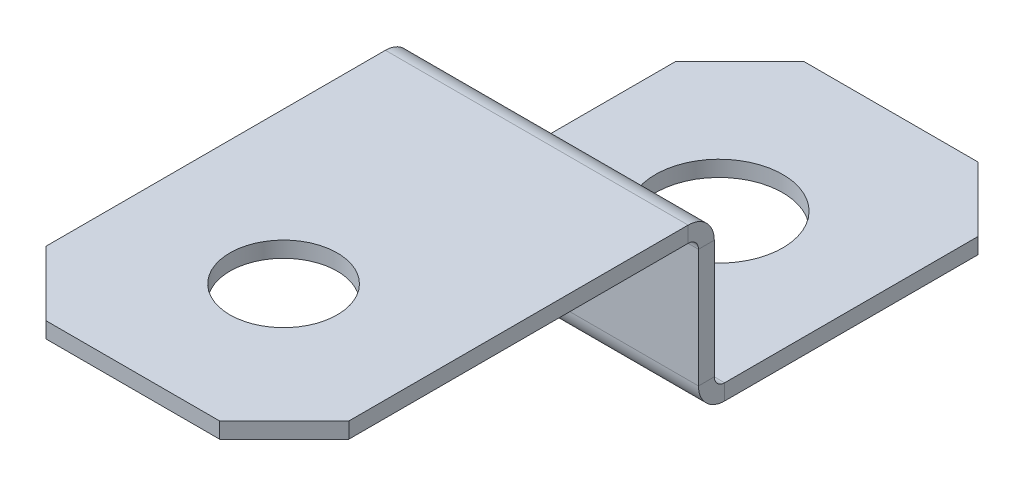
ISO-10303-21;
HEADER;
FILE_DESCRIPTION(('STEP AP214'),'2;1');
FILE_NAME('part.step','',(''),(''),'','','');
FILE_SCHEMA(('AUTOMOTIVE_DESIGN { 1 0 10303 214 1 1 1 1 }'));
ENDSEC;
DATA;
#1=APPLICATION_CONTEXT('core data for automotive mechanical design processes');
#2=APPLICATION_PROTOCOL_DEFINITION('international standard','automotive_design',2000,#1);
#3=PRODUCT_CONTEXT('',#1,'mechanical');
#4=PRODUCT('Part','Part','',(#3));
#5=PRODUCT_RELATED_PRODUCT_CATEGORY('part','',(#4));
#6=PRODUCT_DEFINITION_FORMATION('','',#4);
#7=PRODUCT_DEFINITION_CONTEXT('part definition',#1,'design');
#8=PRODUCT_DEFINITION('design','',#6,#7);
#9=PRODUCT_DEFINITION_SHAPE('','',#8);
#10=(LENGTH_UNIT() NAMED_UNIT(*) SI_UNIT(.MILLI.,.METRE.));
#11=(NAMED_UNIT(*) PLANE_ANGLE_UNIT() SI_UNIT($,.RADIAN.));
#12=(NAMED_UNIT(*) SI_UNIT($,.STERADIAN.) SOLID_ANGLE_UNIT());
#13=UNCERTAINTY_MEASURE_WITH_UNIT(LENGTH_MEASURE(1.E-05),#10,'distance_accuracy_value','');
#14=(GEOMETRIC_REPRESENTATION_CONTEXT(3) GLOBAL_UNCERTAINTY_ASSIGNED_CONTEXT((#13)) GLOBAL_UNIT_ASSIGNED_CONTEXT((#10,
#11,#12)) REPRESENTATION_CONTEXT('',''));
#15=CARTESIAN_POINT('',(0.,0.,0.));
#16=DIRECTION('',(0.,0.,1.));
#17=DIRECTION('',(1.,0.,0.));
#18=AXIS2_PLACEMENT_3D('',#15,#16,#17);
#19=CARTESIAN_POINT('',(5.588,-0.9652,-10.3124));
#20=DIRECTION('',(1.,0.,0.));
#21=DIRECTION('',(0.,0.,-1.));
#22=AXIS2_PLACEMENT_3D('',#19,#20,#21);
#23=PLANE('',#22);
#24=DIRECTION('',(0.,0.,1.));
#25=VECTOR('',#24,1.);
#26=CARTESIAN_POINT('',(5.588,-0.9652,-10.3124));
#27=LINE('',#26,#25);
#28=CARTESIAN_POINT('',(5.588,-0.9652,-10.3124));
#29=VERTEX_POINT('',#28);
#30=CARTESIAN_POINT('',(5.588,-0.9652,-9.7282));
#31=VERTEX_POINT('',#30);
#32=EDGE_CURVE('E272',#29,#31,#27,.T.);
#33=ORIENTED_EDGE('',*,*,#32,.F.);
#34=CARTESIAN_POINT('',(5.588,-0.9652,-9.3472));
#35=DIRECTION('',(1.,0.,0.));
#36=DIRECTION('',(0.,0.,-1.));
#37=AXIS2_PLACEMENT_3D('',#34,#35,#36);
#38=CIRCLE('',#37,0.9652);
#39=CARTESIAN_POINT('',(5.588,0.,-9.3472));
#40=VERTEX_POINT('',#39);
#41=EDGE_CURVE('E189',#40,#29,#38,.F.);
#42=ORIENTED_EDGE('',*,*,#41,.F.);
#43=DIRECTION('',(0.,1.,0.));
#44=VECTOR('',#43,1.);
#45=CARTESIAN_POINT('',(5.588,-0.5842,-9.3472));
#46=LINE('',#45,#44);
#47=CARTESIAN_POINT('',(5.588,-0.5842,-9.3472));
#48=VERTEX_POINT('',#47);
#49=EDGE_CURVE('E269',#48,#40,#46,.T.);
#50=ORIENTED_EDGE('',*,*,#49,.F.);
#51=CARTESIAN_POINT('',(5.588,-0.9652,-9.3472));
#52=DIRECTION('',(1.,0.,0.));
#53=DIRECTION('',(0.,0.,-1.));
#54=AXIS2_PLACEMENT_3D('',#51,#52,#53);
#55=CIRCLE('',#54,0.381);
#56=EDGE_CURVE('E199',#48,#31,#55,.F.);
#57=ORIENTED_EDGE('',*,*,#56,.T.);
#58=EDGE_LOOP('',(#33,#42,#50,#57));
#59=FACE_BOUND('',#58,.T.);
#60=ADVANCED_FACE('F39',(#59),#23,.T.);
#61=CARTESIAN_POINT('',(5.588,-0.5842,-9.3472));
#62=DIRECTION('',(1.,0.,0.));
#63=DIRECTION('',(0.,0.,-1.));
#64=AXIS2_PLACEMENT_3D('',#61,#62,#63);
#65=PLANE('',#64);
#66=DIRECTION('',(0.,-1.,0.));
#67=VECTOR('',#66,1.);
#68=CARTESIAN_POINT('',(5.588,0.,-10.3124));
#69=LINE('',#68,#67);
#70=CARTESIAN_POINT('',(5.588,-5.334,-10.3124));
#71=VERTEX_POINT('',#70);
#72=EDGE_CURVE('E187',#29,#71,#69,.T.);
#73=ORIENTED_EDGE('',*,*,#72,.F.);
#74=ORIENTED_EDGE('',*,*,#32,.T.);
#75=DIRECTION('',(0.,-1.,0.));
#76=VECTOR('',#75,1.);
#77=CARTESIAN_POINT('',(5.588,0.,-9.7282));
#78=LINE('',#77,#76);
#79=CARTESIAN_POINT('',(5.588,-5.334,-9.7282));
#80=VERTEX_POINT('',#79);
#81=EDGE_CURVE('E202',#31,#80,#78,.T.);
#82=ORIENTED_EDGE('',*,*,#81,.T.);
#83=DIRECTION('',(0.,0.,-1.));
#84=VECTOR('',#83,1.);
#85=CARTESIAN_POINT('',(5.588,-5.334,-9.7282));
#86=LINE('',#85,#84);
#87=EDGE_CURVE('E164',#80,#71,#86,.T.);
#88=ORIENTED_EDGE('',*,*,#87,.T.);
#89=EDGE_LOOP('',(#73,#74,#82,#88));
#90=FACE_BOUND('',#89,.T.);
#91=ADVANCED_FACE('F349',(#90),#65,.T.);
#92=CARTESIAN_POINT('',(-5.588,0.,-9.3472));
#93=DIRECTION('',(-1.,0.,0.));
#94=DIRECTION('',(0.,0.,1.));
#95=AXIS2_PLACEMENT_3D('',#92,#93,#94);
#96=PLANE('',#95);
#97=DIRECTION('',(0.,-1.,0.));
#98=VECTOR('',#97,1.);
#99=CARTESIAN_POINT('',(-5.588,0.,-9.3472));
#100=LINE('',#99,#98);
#101=CARTESIAN_POINT('',(-5.588,0.,-9.3472));
#102=VERTEX_POINT('',#101);
#103=CARTESIAN_POINT('',(-5.588,-0.5842,-9.3472));
#104=VERTEX_POINT('',#103);
#105=EDGE_CURVE('E266',#102,#104,#100,.T.);
#106=ORIENTED_EDGE('',*,*,#105,.F.);
#107=CARTESIAN_POINT('',(-5.588,-0.9652,-9.3472));
#108=DIRECTION('',(1.,0.,0.));
#109=DIRECTION('',(0.,0.,-1.));
#110=AXIS2_PLACEMENT_3D('',#107,#108,#109);
#111=CIRCLE('',#110,0.9652);
#112=CARTESIAN_POINT('',(-5.588,-0.9652,-10.3124));
#113=VERTEX_POINT('',#112);
#114=EDGE_CURVE('E217',#102,#113,#111,.F.);
#115=ORIENTED_EDGE('',*,*,#114,.T.);
#116=DIRECTION('',(0.,0.,-1.));
#117=VECTOR('',#116,1.);
#118=CARTESIAN_POINT('',(-5.588,-0.9652,-9.7282));
#119=LINE('',#118,#117);
#120=CARTESIAN_POINT('',(-5.588,-0.9652,-9.7282));
#121=VERTEX_POINT('',#120);
#122=EDGE_CURVE('E163',#121,#113,#119,.T.);
#123=ORIENTED_EDGE('',*,*,#122,.F.);
#124=CARTESIAN_POINT('',(-5.588,-0.9652,-9.3472));
#125=DIRECTION('',(1.,0.,0.));
#126=DIRECTION('',(0.,0.,-1.));
#127=AXIS2_PLACEMENT_3D('',#124,#125,#126);
#128=CIRCLE('',#127,0.381);
#129=EDGE_CURVE('E224',#104,#121,#128,.F.);
#130=ORIENTED_EDGE('',*,*,#129,.F.);
#131=EDGE_LOOP('',(#106,#115,#123,#130));
#132=FACE_BOUND('',#131,.T.);
#133=ADVANCED_FACE('F355',(#132),#96,.T.);
#134=CARTESIAN_POINT('',(-5.588,-0.9652,-9.7282));
#135=DIRECTION('',(-1.,0.,0.));
#136=DIRECTION('',(0.,0.,1.));
#137=AXIS2_PLACEMENT_3D('',#134,#135,#136);
#138=PLANE('',#137);
#139=DIRECTION('',(0.,0.,-1.));
#140=VECTOR('',#139,1.);
#141=CARTESIAN_POINT('',(-5.588,-0.5842,5.5626));
#142=LINE('',#141,#140);
#143=CARTESIAN_POINT('',(-5.588,-0.5842,3.18135));
#144=VERTEX_POINT('',#143);
#145=EDGE_CURVE('E222',#144,#104,#142,.T.);
#146=ORIENTED_EDGE('',*,*,#145,.F.);
#147=DIRECTION('',(0.,1.,0.));
#148=VECTOR('',#147,1.);
#149=CARTESIAN_POINT('',(-5.588,-0.9652,3.18135));
#150=LINE('',#149,#148);
#151=CARTESIAN_POINT('',(-5.588,0.,3.18135));
#152=VERTEX_POINT('',#151);
#153=EDGE_CURVE('E274',#144,#152,#150,.T.);
#154=ORIENTED_EDGE('',*,*,#153,.T.);
#155=DIRECTION('',(0.,0.,-1.));
#156=VECTOR('',#155,1.);
#157=CARTESIAN_POINT('',(-5.588,0.,5.5626));
#158=LINE('',#157,#156);
#159=EDGE_CURVE('E220',#152,#102,#158,.T.);
#160=ORIENTED_EDGE('',*,*,#159,.T.);
#161=ORIENTED_EDGE('',*,*,#105,.T.);
#162=EDGE_LOOP('',(#146,#154,#160,#161));
#163=FACE_BOUND('',#162,.T.);
#164=ADVANCED_FACE('F453',(#163),#138,.T.);
#165=CARTESIAN_POINT('',(5.588,-5.715,-10.6934));
#166=DIRECTION('',(1.,0.,0.));
#167=DIRECTION('',(0.,0.,-1.));
#168=AXIS2_PLACEMENT_3D('',#165,#166,#167);
#169=PLANE('',#168);
#170=DIRECTION('',(0.,-1.,0.));
#171=VECTOR('',#170,1.);
#172=CARTESIAN_POINT('',(5.588,-5.715,-10.6934));
#173=LINE('',#172,#171);
#174=CARTESIAN_POINT('',(5.588,-5.715,-10.6934));
#175=VERTEX_POINT('',#174);
#176=CARTESIAN_POINT('',(5.588,-6.2992,-10.6934));
#177=VERTEX_POINT('',#176);
#178=EDGE_CURVE('E154',#175,#177,#173,.T.);
#179=ORIENTED_EDGE('',*,*,#178,.F.);
#180=CARTESIAN_POINT('',(5.588,-5.334,-10.6934));
#181=DIRECTION('',(-1.,0.,0.));
#182=DIRECTION('',(0.,0.,1.));
#183=AXIS2_PLACEMENT_3D('',#180,#181,#182);
#184=CIRCLE('',#183,0.381);
#185=EDGE_CURVE('E158',#71,#175,#184,.F.);
#186=ORIENTED_EDGE('',*,*,#185,.F.);
#187=ORIENTED_EDGE('',*,*,#87,.F.);
#188=CARTESIAN_POINT('',(5.588,-5.334,-10.6934));
#189=DIRECTION('',(1.,0.,0.));
#190=DIRECTION('',(0.,0.,-1.));
#191=AXIS2_PLACEMENT_3D('',#188,#189,#190);
#192=CIRCLE('',#191,0.9652);
#193=EDGE_CURVE('E161',#80,#177,#192,.T.);
#194=ORIENTED_EDGE('',*,*,#193,.T.);
#195=EDGE_LOOP('',(#179,#186,#187,#194));
#196=FACE_BOUND('',#195,.T.);
#197=ADVANCED_FACE('F156',(#196),#169,.T.);
#198=CARTESIAN_POINT('',(5.588,-5.334,-9.7282));
#199=DIRECTION('',(1.,0.,0.));
#200=DIRECTION('',(0.,0.,-1.));
#201=AXIS2_PLACEMENT_3D('',#198,#199,#200);
#202=PLANE('',#201);
#203=DIRECTION('',(0.,0.,-1.));
#204=VECTOR('',#203,1.);
#205=CARTESIAN_POINT('',(5.588,-6.2992,-10.3124));
#206=LINE('',#205,#204);
#207=CARTESIAN_POINT('',(5.588,-6.2992,-20.04695));
#208=VERTEX_POINT('',#207);
#209=EDGE_CURVE('E182',#177,#208,#206,.T.);
#210=ORIENTED_EDGE('',*,*,#209,.T.);
#211=DIRECTION('',(0.,1.,0.));
#212=VECTOR('',#211,1.);
#213=CARTESIAN_POINT('',(5.588,-5.334,-20.04695));
#214=LINE('',#213,#212);
#215=CARTESIAN_POINT('',(5.588,-5.715,-20.04695));
#216=VERTEX_POINT('',#215);
#217=EDGE_CURVE('E11',#208,#216,#214,.T.);
#218=ORIENTED_EDGE('',*,*,#217,.T.);
#219=DIRECTION('',(0.,0.,-1.));
#220=VECTOR('',#219,1.);
#221=CARTESIAN_POINT('',(5.588,-5.715,-10.3124));
#222=LINE('',#221,#220);
#223=EDGE_CURVE('E171',#175,#216,#222,.T.);
#224=ORIENTED_EDGE('',*,*,#223,.F.);
#225=ORIENTED_EDGE('',*,*,#178,.T.);
#226=EDGE_LOOP('',(#210,#218,#224,#225));
#227=FACE_BOUND('',#226,.T.);
#228=ADVANCED_FACE('F181',(#227),#202,.T.);
#229=CARTESIAN_POINT('',(-5.588,-5.334,-10.3124));
#230=DIRECTION('',(-1.,0.,0.));
#231=DIRECTION('',(0.,0.,1.));
#232=AXIS2_PLACEMENT_3D('',#229,#230,#231);
#233=PLANE('',#232);
#234=DIRECTION('',(0.,0.,1.));
#235=VECTOR('',#234,1.);
#236=CARTESIAN_POINT('',(-5.588,-5.334,-10.3124));
#237=LINE('',#236,#235);
#238=CARTESIAN_POINT('',(-5.588,-5.334,-10.3124));
#239=VERTEX_POINT('',#238);
#240=CARTESIAN_POINT('',(-5.588,-5.334,-9.7282));
#241=VERTEX_POINT('',#240);
#242=EDGE_CURVE('E262',#239,#241,#237,.T.);
#243=ORIENTED_EDGE('',*,*,#242,.F.);
#244=CARTESIAN_POINT('',(-5.588,-5.334,-10.6934));
#245=DIRECTION('',(-1.,0.,0.));
#246=DIRECTION('',(0.,0.,1.));
#247=AXIS2_PLACEMENT_3D('',#244,#245,#246);
#248=CIRCLE('',#247,0.381);
#249=CARTESIAN_POINT('',(-5.588,-5.715,-10.6934));
#250=VERTEX_POINT('',#249);
#251=EDGE_CURVE('E212',#239,#250,#248,.F.);
#252=ORIENTED_EDGE('',*,*,#251,.T.);
#253=DIRECTION('',(0.,1.,0.));
#254=VECTOR('',#253,1.);
#255=CARTESIAN_POINT('',(-5.588,-6.2992,-10.6934));
#256=LINE('',#255,#254);
#257=CARTESIAN_POINT('',(-5.588,-6.2992,-10.6934));
#258=VERTEX_POINT('',#257);
#259=EDGE_CURVE('E260',#258,#250,#256,.T.);
#260=ORIENTED_EDGE('',*,*,#259,.F.);
#261=CARTESIAN_POINT('',(-5.588,-5.334,-10.6934));
#262=DIRECTION('',(1.,0.,0.));
#263=DIRECTION('',(0.,0.,-1.));
#264=AXIS2_PLACEMENT_3D('',#261,#262,#263);
#265=CIRCLE('',#264,0.9652);
#266=EDGE_CURVE('E230',#241,#258,#265,.T.);
#267=ORIENTED_EDGE('',*,*,#266,.F.);
#268=EDGE_LOOP('',(#243,#252,#260,#267));
#269=FACE_BOUND('',#268,.T.);
#270=ADVANCED_FACE('F438',(#269),#233,.T.);
#271=CARTESIAN_POINT('',(-5.588,-6.2992,-10.6934));
#272=DIRECTION('',(-1.,0.,0.));
#273=DIRECTION('',(0.,0.,1.));
#274=AXIS2_PLACEMENT_3D('',#271,#272,#273);
#275=PLANE('',#274);
#276=DIRECTION('',(0.,-1.,0.));
#277=VECTOR('',#276,1.);
#278=CARTESIAN_POINT('',(-5.588,0.,-10.3124));
#279=LINE('',#278,#277);
#280=EDGE_CURVE('E214',#113,#239,#279,.T.);
#281=ORIENTED_EDGE('',*,*,#280,.T.);
#282=ORIENTED_EDGE('',*,*,#242,.T.);
#283=DIRECTION('',(0.,-1.,0.));
#284=VECTOR('',#283,1.);
#285=CARTESIAN_POINT('',(-5.588,0.,-9.7282));
#286=LINE('',#285,#284);
#287=EDGE_CURVE('E227',#121,#241,#286,.T.);
#288=ORIENTED_EDGE('',*,*,#287,.F.);
#289=ORIENTED_EDGE('',*,*,#122,.T.);
#290=EDGE_LOOP('',(#281,#282,#288,#289));
#291=FACE_BOUND('',#290,.T.);
#292=ADVANCED_FACE('F439',(#291),#275,.T.);
#293=CARTESIAN_POINT('',(5.588,-6.2992,-10.3124));
#294=DIRECTION('',(0.,1.,0.));
#295=DIRECTION('',(0.,0.,1.));
#296=AXIS2_PLACEMENT_3D('',#293,#294,#295);
#297=PLANE('',#296);
#298=CARTESIAN_POINT('',(0.,-6.2992,-16.0782));
#299=DIRECTION('',(0.,1.,0.));
#300=DIRECTION('',(0.,0.,1.));
#301=AXIS2_PLACEMENT_3D('',#298,#299,#300);
#302=CIRCLE('',#301,2.3495);
#303=CARTESIAN_POINT('',(0.,-6.2992,-13.7287));
#304=VERTEX_POINT('',#303);
#305=EDGE_CURVE('E322',#304,#304,#302,.T.);
#306=ORIENTED_EDGE('',*,*,#305,.T.);
#307=EDGE_LOOP('',(#306));
#308=FACE_BOUND('',#307,.T.);
#309=DIRECTION('',(0.,0.,-1.));
#310=VECTOR('',#309,1.);
#311=CARTESIAN_POINT('',(-5.588,-6.2992,-10.3124));
#312=LINE('',#311,#310);
#313=CARTESIAN_POINT('',(-5.588,-6.2992,-20.04695));
#314=VERTEX_POINT('',#313);
#315=EDGE_CURVE('E207',#258,#314,#312,.T.);
#316=ORIENTED_EDGE('',*,*,#315,.T.);
#317=DIRECTION('',(-0.707106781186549,0.,0.707106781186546));
#318=VECTOR('',#317,1.);
#319=CARTESIAN_POINT('',(-5.588,-6.2992,-20.04695));
#320=LINE('',#319,#318);
#321=CARTESIAN_POINT('',(-3.20675,-6.2992,-22.4282));
#322=VERTEX_POINT('',#321);
#323=EDGE_CURVE('E297',#314,#322,#320,.F.);
#324=ORIENTED_EDGE('',*,*,#323,.T.);
#325=DIRECTION('',(-1.,0.,0.));
#326=VECTOR('',#325,1.);
#327=CARTESIAN_POINT('',(5.588,-6.2992,-22.4282));
#328=LINE('',#327,#326);
#329=CARTESIAN_POINT('',(3.20675,-6.2992,-22.4282));
#330=VERTEX_POINT('',#329);
#331=EDGE_CURVE('E258',#330,#322,#328,.T.);
#332=ORIENTED_EDGE('',*,*,#331,.F.);
#333=DIRECTION('',(-0.707106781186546,0.,-0.707106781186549));
#334=VECTOR('',#333,1.);
#335=CARTESIAN_POINT('',(3.20675,-6.2992,-22.4282));
#336=LINE('',#335,#334);
#337=EDGE_CURVE('E295',#330,#208,#336,.F.);
#338=ORIENTED_EDGE('',*,*,#337,.T.);
#339=ORIENTED_EDGE('',*,*,#209,.F.);
#340=DIRECTION('',(-1.,0.,0.));
#341=VECTOR('',#340,1.);
#342=CARTESIAN_POINT('',(5.588,-6.2992,-10.6934));
#343=LINE('',#342,#341);
#344=EDGE_CURVE('E206',#177,#258,#343,.T.);
#345=ORIENTED_EDGE('',*,*,#344,.T.);
#346=EDGE_LOOP('',(#316,#324,#332,#338,#339,#345));
#347=FACE_BOUND('',#346,.T.);
#348=ADVANCED_FACE('F313',(#308,#347),#297,.F.);
#349=CARTESIAN_POINT('',(5.588,-5.715,-22.4282));
#350=DIRECTION('',(0.,0.,-1.));
#351=DIRECTION('',(-1.,0.,0.));
#352=AXIS2_PLACEMENT_3D('',#349,#350,#351);
#353=PLANE('',#352);
#354=ORIENTED_EDGE('',*,*,#331,.T.);
#355=DIRECTION('',(0.,1.,0.));
#356=VECTOR('',#355,1.);
#357=CARTESIAN_POINT('',(-3.20675,-5.715,-22.4282));
#358=LINE('',#357,#356);
#359=CARTESIAN_POINT('',(-3.20675,-5.715,-22.4282));
#360=VERTEX_POINT('',#359);
#361=EDGE_CURVE('E60',#322,#360,#358,.T.);
#362=ORIENTED_EDGE('',*,*,#361,.T.);
#363=DIRECTION('',(-1.,0.,0.));
#364=VECTOR('',#363,1.);
#365=CARTESIAN_POINT('',(5.588,-5.715,-22.4282));
#366=LINE('',#365,#364);
#367=CARTESIAN_POINT('',(3.20675,-5.715,-22.4282));
#368=VERTEX_POINT('',#367);
#369=EDGE_CURVE('E178',#368,#360,#366,.T.);
#370=ORIENTED_EDGE('',*,*,#369,.F.);
#371=DIRECTION('',(0.,-1.,0.));
#372=VECTOR('',#371,1.);
#373=CARTESIAN_POINT('',(3.20675,-5.715,-22.4282));
#374=LINE('',#373,#372);
#375=EDGE_CURVE('E299',#368,#330,#374,.T.);
#376=ORIENTED_EDGE('',*,*,#375,.T.);
#377=EDGE_LOOP('',(#354,#362,#370,#376));
#378=FACE_BOUND('',#377,.T.);
#379=ADVANCED_FACE('F314',(#378),#353,.T.);
#380=CARTESIAN_POINT('',(5.588,-5.715,-10.3124));
#381=DIRECTION('',(0.,1.,0.));
#382=DIRECTION('',(0.,0.,1.));
#383=AXIS2_PLACEMENT_3D('',#380,#381,#382);
#384=PLANE('',#383);
#385=CARTESIAN_POINT('',(0.,-5.715,-16.0782));
#386=DIRECTION('',(0.,1.,0.));
#387=DIRECTION('',(0.,0.,1.));
#388=AXIS2_PLACEMENT_3D('',#385,#386,#387);
#389=CIRCLE('',#388,2.3495);
#390=CARTESIAN_POINT('',(0.,-5.715,-13.7287));
#391=VERTEX_POINT('',#390);
#392=EDGE_CURVE('E325',#391,#391,#389,.T.);
#393=ORIENTED_EDGE('',*,*,#392,.F.);
#394=EDGE_LOOP('',(#393));
#395=FACE_BOUND('',#394,.T.);
#396=ORIENTED_EDGE('',*,*,#369,.T.);
#397=DIRECTION('',(0.707106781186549,0.,-0.707106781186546));
#398=VECTOR('',#397,1.);
#399=CARTESIAN_POINT('',(-4.86727499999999,-5.715,-20.767675));
#400=LINE('',#399,#398);
#401=CARTESIAN_POINT('',(-5.588,-5.715,-20.04695));
#402=VERTEX_POINT('',#401);
#403=EDGE_CURVE('E47',#360,#402,#400,.F.);
#404=ORIENTED_EDGE('',*,*,#403,.T.);
#405=DIRECTION('',(0.,0.,-1.));
#406=VECTOR('',#405,1.);
#407=CARTESIAN_POINT('',(-5.588,-5.715,-10.3124));
#408=LINE('',#407,#406);
#409=EDGE_CURVE('E174',#250,#402,#408,.T.);
#410=ORIENTED_EDGE('',*,*,#409,.F.);
#411=DIRECTION('',(-1.,0.,0.));
#412=VECTOR('',#411,1.);
#413=CARTESIAN_POINT('',(5.588,-5.715,-10.6934));
#414=LINE('',#413,#412);
#415=EDGE_CURVE('E169',#175,#250,#414,.T.);
#416=ORIENTED_EDGE('',*,*,#415,.F.);
#417=ORIENTED_EDGE('',*,*,#223,.T.);
#418=DIRECTION('',(0.707106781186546,0.,0.707106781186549));
#419=VECTOR('',#418,1.);
#420=CARTESIAN_POINT('',(10.455275,-5.715,-15.179675));
#421=LINE('',#420,#419);
#422=EDGE_CURVE('E303',#216,#368,#421,.F.);
#423=ORIENTED_EDGE('',*,*,#422,.T.);
#424=EDGE_LOOP('',(#396,#404,#410,#416,#417,#423));
#425=FACE_BOUND('',#424,.T.);
#426=ADVANCED_FACE('F170',(#395,#425),#384,.T.);
#427=CARTESIAN_POINT('',(5.588,-5.334,-10.6934));
#428=DIRECTION('',(-1.,0.,0.));
#429=DIRECTION('',(0.,0.,1.));
#430=AXIS2_PLACEMENT_3D('',#427,#428,#429);
#431=CYLINDRICAL_SURFACE('',#430,0.381);
#432=ORIENTED_EDGE('',*,*,#251,.F.);
#433=DIRECTION('',(-1.,0.,0.));
#434=VECTOR('',#433,1.);
#435=CARTESIAN_POINT('',(5.588,-5.334,-10.3124));
#436=LINE('',#435,#434);
#437=EDGE_CURVE('E179',#71,#239,#436,.T.);
#438=ORIENTED_EDGE('',*,*,#437,.F.);
#439=ORIENTED_EDGE('',*,*,#185,.T.);
#440=ORIENTED_EDGE('',*,*,#415,.T.);
#441=EDGE_LOOP('',(#432,#438,#439,#440));
#442=FACE_BOUND('',#441,.T.);
#443=ADVANCED_FACE('F185',(#442),#431,.F.);
#444=CARTESIAN_POINT('',(5.588,0.,-10.3124));
#445=DIRECTION('',(0.,0.,-1.));
#446=DIRECTION('',(0.,1.,0.));
#447=AXIS2_PLACEMENT_3D('',#444,#445,#446);
#448=PLANE('',#447);
#449=ORIENTED_EDGE('',*,*,#280,.F.);
#450=DIRECTION('',(-1.,0.,0.));
#451=VECTOR('',#450,1.);
#452=CARTESIAN_POINT('',(5.588,-0.9652,-10.3124));
#453=LINE('',#452,#451);
#454=EDGE_CURVE('E253',#29,#113,#453,.T.);
#455=ORIENTED_EDGE('',*,*,#454,.F.);
#456=ORIENTED_EDGE('',*,*,#72,.T.);
#457=ORIENTED_EDGE('',*,*,#437,.T.);
#458=EDGE_LOOP('',(#449,#455,#456,#457));
#459=FACE_BOUND('',#458,.T.);
#460=ADVANCED_FACE('F345',(#459),#448,.T.);
#461=CARTESIAN_POINT('',(5.588,-0.9652,-9.3472));
#462=DIRECTION('',(-1.,0.,0.));
#463=DIRECTION('',(0.,0.,1.));
#464=AXIS2_PLACEMENT_3D('',#461,#462,#463);
#465=CYLINDRICAL_SURFACE('',#464,0.9652);
#466=ORIENTED_EDGE('',*,*,#114,.F.);
#467=DIRECTION('',(-1.,0.,0.));
#468=VECTOR('',#467,1.);
#469=CARTESIAN_POINT('',(5.588,0.,-9.3472));
#470=LINE('',#469,#468);
#471=EDGE_CURVE('E250',#40,#102,#470,.T.);
#472=ORIENTED_EDGE('',*,*,#471,.F.);
#473=ORIENTED_EDGE('',*,*,#41,.T.);
#474=ORIENTED_EDGE('',*,*,#454,.T.);
#475=EDGE_LOOP('',(#466,#472,#473,#474));
#476=FACE_BOUND('',#475,.T.);
#477=ADVANCED_FACE('F410',(#476),#465,.T.);
#478=CARTESIAN_POINT('',(5.588,0.,5.5626));
#479=DIRECTION('',(0.,1.,0.));
#480=DIRECTION('',(0.,0.,1.));
#481=AXIS2_PLACEMENT_3D('',#478,#479,#480);
#482=PLANE('',#481);
#483=CARTESIAN_POINT('',(0.,0.,0.));
#484=DIRECTION('',(0.,1.,0.));
#485=DIRECTION('',(0.,0.,1.));
#486=AXIS2_PLACEMENT_3D('',#483,#484,#485);
#487=CIRCLE('',#486,1.9812);
#488=CARTESIAN_POINT('',(0.,0.,1.9812));
#489=VERTEX_POINT('',#488);
#490=EDGE_CURVE('E319',#489,#489,#487,.T.);
#491=ORIENTED_EDGE('',*,*,#490,.F.);
#492=EDGE_LOOP('',(#491));
#493=FACE_BOUND('',#492,.T.);
#494=ORIENTED_EDGE('',*,*,#159,.F.);
#495=DIRECTION('',(-0.707106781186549,0.,-0.707106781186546));
#496=VECTOR('',#495,1.);
#497=CARTESIAN_POINT('',(1.19062500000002,0.,9.959975));
#498=LINE('',#497,#496);
#499=CARTESIAN_POINT('',(-3.20674999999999,0.,5.5626));
#500=VERTEX_POINT('',#499);
#501=EDGE_CURVE('E279',#152,#500,#498,.F.);
#502=ORIENTED_EDGE('',*,*,#501,.T.);
#503=DIRECTION('',(-1.,0.,0.));
#504=VECTOR('',#503,1.);
#505=CARTESIAN_POINT('',(5.588,0.,5.5626));
#506=LINE('',#505,#504);
#507=CARTESIAN_POINT('',(3.20675,0.,5.5626));
#508=VERTEX_POINT('',#507);
#509=EDGE_CURVE('E247',#508,#500,#506,.T.);
#510=ORIENTED_EDGE('',*,*,#509,.F.);
#511=DIRECTION('',(0.707106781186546,0.,-0.707106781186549));
#512=VECTOR('',#511,1.);
#513=CARTESIAN_POINT('',(4.39737499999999,0.,4.371975));
#514=LINE('',#513,#512);
#515=CARTESIAN_POINT('',(5.588,0.,3.18134999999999));
#516=VERTEX_POINT('',#515);
#517=EDGE_CURVE('E277',#508,#516,#514,.T.);
#518=ORIENTED_EDGE('',*,*,#517,.T.);
#519=DIRECTION('',(0.,0.,-1.));
#520=VECTOR('',#519,1.);
#521=CARTESIAN_POINT('',(5.588,0.,5.5626));
#522=LINE('',#521,#520);
#523=EDGE_CURVE('E195',#516,#40,#522,.T.);
#524=ORIENTED_EDGE('',*,*,#523,.T.);
#525=ORIENTED_EDGE('',*,*,#471,.T.);
#526=EDGE_LOOP('',(#494,#502,#510,#518,#524,#525));
#527=FACE_BOUND('',#526,.T.);
#528=ADVANCED_FACE('F406',(#493,#527),#482,.T.);
#529=CARTESIAN_POINT('',(5.588,-0.5842,5.5626));
#530=DIRECTION('',(0.,0.,1.));
#531=DIRECTION('',(1.,0.,0.));
#532=AXIS2_PLACEMENT_3D('',#529,#530,#531);
#533=PLANE('',#532);
#534=ORIENTED_EDGE('',*,*,#509,.T.);
#535=DIRECTION('',(0.,-1.,0.));
#536=VECTOR('',#535,1.);
#537=CARTESIAN_POINT('',(-3.20674999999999,-0.5842,5.5626));
#538=LINE('',#537,#536);
#539=CARTESIAN_POINT('',(-3.20674999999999,-0.5842,5.5626));
#540=VERTEX_POINT('',#539);
#541=EDGE_CURVE('E284',#500,#540,#538,.T.);
#542=ORIENTED_EDGE('',*,*,#541,.T.);
#543=DIRECTION('',(-1.,0.,0.));
#544=VECTOR('',#543,1.);
#545=CARTESIAN_POINT('',(5.588,-0.5842,5.5626));
#546=LINE('',#545,#544);
#547=CARTESIAN_POINT('',(3.20675,-0.5842,5.5626));
#548=VERTEX_POINT('',#547);
#549=EDGE_CURVE('E244',#548,#540,#546,.T.);
#550=ORIENTED_EDGE('',*,*,#549,.F.);
#551=DIRECTION('',(0.,1.,0.));
#552=VECTOR('',#551,1.);
#553=CARTESIAN_POINT('',(3.20675,0.,5.5626));
#554=LINE('',#553,#552);
#555=EDGE_CURVE('E281',#548,#508,#554,.T.);
#556=ORIENTED_EDGE('',*,*,#555,.T.);
#557=EDGE_LOOP('',(#534,#542,#550,#556));
#558=FACE_BOUND('',#557,.T.);
#559=ADVANCED_FACE('F402',(#558),#533,.T.);
#560=CARTESIAN_POINT('',(5.588,-0.5842,5.5626));
#561=DIRECTION('',(0.,1.,0.));
#562=DIRECTION('',(0.,0.,1.));
#563=AXIS2_PLACEMENT_3D('',#560,#561,#562);
#564=PLANE('',#563);
#565=CARTESIAN_POINT('',(0.,-0.5842,0.));
#566=DIRECTION('',(0.,1.,0.));
#567=DIRECTION('',(0.,0.,1.));
#568=AXIS2_PLACEMENT_3D('',#565,#566,#567);
#569=CIRCLE('',#568,1.9812);
#570=CARTESIAN_POINT('',(0.,-0.5842,1.9812));
#571=VERTEX_POINT('',#570);
#572=EDGE_CURVE('E210',#571,#571,#569,.T.);
#573=ORIENTED_EDGE('',*,*,#572,.T.);
#574=EDGE_LOOP('',(#573));
#575=FACE_BOUND('',#574,.T.);
#576=ORIENTED_EDGE('',*,*,#549,.T.);
#577=DIRECTION('',(0.707106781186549,0.,0.707106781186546));
#578=VECTOR('',#577,1.);
#579=CARTESIAN_POINT('',(-5.588,-0.5842,3.18135));
#580=LINE('',#579,#578);
#581=EDGE_CURVE('E288',#540,#144,#580,.F.);
#582=ORIENTED_EDGE('',*,*,#581,.T.);
#583=ORIENTED_EDGE('',*,*,#145,.T.);
#584=DIRECTION('',(-1.,0.,0.));
#585=VECTOR('',#584,1.);
#586=CARTESIAN_POINT('',(5.588,-0.5842,-9.3472));
#587=LINE('',#586,#585);
#588=EDGE_CURVE('E241',#48,#104,#587,.T.);
#589=ORIENTED_EDGE('',*,*,#588,.F.);
#590=DIRECTION('',(0.,0.,-1.));
#591=VECTOR('',#590,1.);
#592=CARTESIAN_POINT('',(5.588,-0.5842,5.5626));
#593=LINE('',#592,#591);
#594=CARTESIAN_POINT('',(5.588,-0.5842,3.18134999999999));
#595=VERTEX_POINT('',#594);
#596=EDGE_CURVE('E197',#595,#48,#593,.T.);
#597=ORIENTED_EDGE('',*,*,#596,.F.);
#598=DIRECTION('',(-0.707106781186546,0.,0.707106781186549));
#599=VECTOR('',#598,1.);
#600=CARTESIAN_POINT('',(3.20675,-0.5842,5.5626));
#601=LINE('',#600,#599);
#602=EDGE_CURVE('E286',#595,#548,#601,.T.);
#603=ORIENTED_EDGE('',*,*,#602,.T.);
#604=EDGE_LOOP('',(#576,#582,#583,#589,#597,#603));
#605=FACE_BOUND('',#604,.T.);
#606=ADVANCED_FACE('F398',(#575,#605),#564,.F.);
#607=CARTESIAN_POINT('',(5.588,-0.9652,-9.3472));
#608=DIRECTION('',(-1.,0.,0.));
#609=DIRECTION('',(0.,0.,1.));
#610=AXIS2_PLACEMENT_3D('',#607,#608,#609);
#611=CYLINDRICAL_SURFACE('',#610,0.381);
#612=ORIENTED_EDGE('',*,*,#129,.T.);
#613=DIRECTION('',(-1.,0.,0.));
#614=VECTOR('',#613,1.);
#615=CARTESIAN_POINT('',(5.588,-0.9652,-9.7282));
#616=LINE('',#615,#614);
#617=EDGE_CURVE('E238',#31,#121,#616,.T.);
#618=ORIENTED_EDGE('',*,*,#617,.F.);
#619=ORIENTED_EDGE('',*,*,#56,.F.);
#620=ORIENTED_EDGE('',*,*,#588,.T.);
#621=EDGE_LOOP('',(#612,#618,#619,#620));
#622=FACE_BOUND('',#621,.T.);
#623=ADVANCED_FACE('F394',(#622),#611,.F.);
#624=CARTESIAN_POINT('',(5.588,0.,-9.7282));
#625=DIRECTION('',(0.,0.,-1.));
#626=DIRECTION('',(0.,1.,0.));
#627=AXIS2_PLACEMENT_3D('',#624,#625,#626);
#628=PLANE('',#627);
#629=ORIENTED_EDGE('',*,*,#287,.T.);
#630=DIRECTION('',(-1.,0.,0.));
#631=VECTOR('',#630,1.);
#632=CARTESIAN_POINT('',(5.588,-5.334,-9.7282));
#633=LINE('',#632,#631);
#634=EDGE_CURVE('E235',#80,#241,#633,.T.);
#635=ORIENTED_EDGE('',*,*,#634,.F.);
#636=ORIENTED_EDGE('',*,*,#81,.F.);
#637=ORIENTED_EDGE('',*,*,#617,.T.);
#638=EDGE_LOOP('',(#629,#635,#636,#637));
#639=FACE_BOUND('',#638,.T.);
#640=ADVANCED_FACE('F390',(#639),#628,.F.);
#641=CARTESIAN_POINT('',(5.588,-5.334,-10.6934));
#642=DIRECTION('',(-1.,0.,0.));
#643=DIRECTION('',(0.,0.,1.));
#644=AXIS2_PLACEMENT_3D('',#641,#642,#643);
#645=CYLINDRICAL_SURFACE('',#644,0.9652);
#646=ORIENTED_EDGE('',*,*,#266,.T.);
#647=ORIENTED_EDGE('',*,*,#344,.F.);
#648=ORIENTED_EDGE('',*,*,#193,.F.);
#649=ORIENTED_EDGE('',*,*,#634,.T.);
#650=EDGE_LOOP('',(#646,#647,#648,#649));
#651=FACE_BOUND('',#650,.T.);
#652=ADVANCED_FACE('F384',(#651),#645,.T.);
#653=CARTESIAN_POINT('',(5.588,-5.334,-10.6934));
#654=DIRECTION('',(-1.,0.,0.));
#655=DIRECTION('',(0.,0.,1.));
#656=AXIS2_PLACEMENT_3D('',#653,#654,#655);
#657=PLANE('',#656);
#658=ORIENTED_EDGE('',*,*,#523,.F.);
#659=DIRECTION('',(0.,-1.,0.));
#660=VECTOR('',#659,1.);
#661=CARTESIAN_POINT('',(5.588,-0.5842,3.18134999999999));
#662=LINE('',#661,#660);
#663=EDGE_CURVE('E290',#516,#595,#662,.T.);
#664=ORIENTED_EDGE('',*,*,#663,.T.);
#665=ORIENTED_EDGE('',*,*,#596,.T.);
#666=ORIENTED_EDGE('',*,*,#49,.T.);
#667=EDGE_LOOP('',(#658,#664,#665,#666));
#668=FACE_BOUND('',#667,.T.);
#669=ADVANCED_FACE('F381',(#668),#657,.F.);
#670=CARTESIAN_POINT('',(-5.588,-5.334,-10.6934));
#671=DIRECTION('',(-1.,0.,0.));
#672=DIRECTION('',(0.,0.,1.));
#673=AXIS2_PLACEMENT_3D('',#670,#671,#672);
#674=PLANE('',#673);
#675=ORIENTED_EDGE('',*,*,#409,.T.);
#676=DIRECTION('',(0.,-1.,0.));
#677=VECTOR('',#676,1.);
#678=CARTESIAN_POINT('',(-5.588,-5.334,-20.04695));
#679=LINE('',#678,#677);
#680=EDGE_CURVE('E292',#402,#314,#679,.T.);
#681=ORIENTED_EDGE('',*,*,#680,.T.);
#682=ORIENTED_EDGE('',*,*,#315,.F.);
#683=ORIENTED_EDGE('',*,*,#259,.T.);
#684=EDGE_LOOP('',(#675,#681,#682,#683));
#685=FACE_BOUND('',#684,.T.);
#686=ADVANCED_FACE('F308',(#685),#674,.T.);
#687=CARTESIAN_POINT('',(-5.588,-0.9652,3.18135));
#688=DIRECTION('',(0.707106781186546,0.,-0.707106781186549));
#689=DIRECTION('',(0.,1.,0.));
#690=AXIS2_PLACEMENT_3D('',#687,#688,#689);
#691=PLANE('',#690);
#692=ORIENTED_EDGE('',*,*,#581,.F.);
#693=ORIENTED_EDGE('',*,*,#541,.F.);
#694=ORIENTED_EDGE('',*,*,#501,.F.);
#695=ORIENTED_EDGE('',*,*,#153,.F.);
#696=EDGE_LOOP('',(#692,#693,#694,#695));
#697=FACE_BOUND('',#696,.T.);
#698=ADVANCED_FACE('F360',(#697),#691,.F.);
#699=CARTESIAN_POINT('',(3.20675,-0.5842,5.5626));
#700=DIRECTION('',(0.707106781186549,0.,0.707106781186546));
#701=DIRECTION('',(0.,-1.,0.));
#702=AXIS2_PLACEMENT_3D('',#699,#700,#701);
#703=PLANE('',#702);
#704=ORIENTED_EDGE('',*,*,#602,.F.);
#705=ORIENTED_EDGE('',*,*,#663,.F.);
#706=ORIENTED_EDGE('',*,*,#517,.F.);
#707=ORIENTED_EDGE('',*,*,#555,.F.);
#708=EDGE_LOOP('',(#704,#705,#706,#707));
#709=FACE_BOUND('',#708,.T.);
#710=ADVANCED_FACE('F363',(#709),#703,.T.);
#711=CARTESIAN_POINT('',(-5.588,-5.334,-20.04695));
#712=DIRECTION('',(0.707106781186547,0.,0.707106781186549));
#713=DIRECTION('',(0.,-1.,0.));
#714=AXIS2_PLACEMENT_3D('',#711,#712,#713);
#715=PLANE('',#714);
#716=ORIENTED_EDGE('',*,*,#403,.F.);
#717=ORIENTED_EDGE('',*,*,#361,.F.);
#718=ORIENTED_EDGE('',*,*,#323,.F.);
#719=ORIENTED_EDGE('',*,*,#680,.F.);
#720=EDGE_LOOP('',(#716,#717,#718,#719));
#721=FACE_BOUND('',#720,.T.);
#722=ADVANCED_FACE('F310',(#721),#715,.F.);
#723=CARTESIAN_POINT('',(3.20675,-5.715,-22.4282));
#724=DIRECTION('',(-0.707106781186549,0.,0.707106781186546));
#725=DIRECTION('',(0.,-1.,0.));
#726=AXIS2_PLACEMENT_3D('',#723,#724,#725);
#727=PLANE('',#726);
#728=ORIENTED_EDGE('',*,*,#422,.F.);
#729=ORIENTED_EDGE('',*,*,#217,.F.);
#730=ORIENTED_EDGE('',*,*,#337,.F.);
#731=ORIENTED_EDGE('',*,*,#375,.F.);
#732=EDGE_LOOP('',(#728,#729,#730,#731));
#733=FACE_BOUND('',#732,.T.);
#734=ADVANCED_FACE('F41',(#733),#727,.F.);
#735=CARTESIAN_POINT('',(0.,-0.5842,0.));
#736=DIRECTION('',(0.,1.,0.));
#737=DIRECTION('',(0.,0.,1.));
#738=AXIS2_PLACEMENT_3D('',#735,#736,#737);
#739=CYLINDRICAL_SURFACE('',#738,1.9812);
#740=ORIENTED_EDGE('',*,*,#572,.F.);
#741=EDGE_LOOP('',(#740));
#742=FACE_BOUND('',#741,.T.);
#743=ORIENTED_EDGE('',*,*,#490,.T.);
#744=EDGE_LOOP('',(#743));
#745=FACE_BOUND('',#744,.T.);
#746=ADVANCED_FACE('F335',(#742,#745),#739,.F.);
#747=CARTESIAN_POINT('',(0.,-6.2992,-16.0782));
#748=DIRECTION('',(0.,1.,0.));
#749=DIRECTION('',(0.,0.,1.));
#750=AXIS2_PLACEMENT_3D('',#747,#748,#749);
#751=CYLINDRICAL_SURFACE('',#750,2.3495);
#752=ORIENTED_EDGE('',*,*,#305,.F.);
#753=EDGE_LOOP('',(#752));
#754=FACE_BOUND('',#753,.T.);
#755=ORIENTED_EDGE('',*,*,#392,.T.);
#756=EDGE_LOOP('',(#755));
#757=FACE_BOUND('',#756,.T.);
#758=ADVANCED_FACE('F332',(#754,#757),#751,.F.);
#759=CLOSED_SHELL('',(#60,#91,#133,#164,#197,#228,#270,#292,#348,#379,#426,#443,#460,#477,#528,
#559,#606,#623,#640,#652,#669,#686,#698,#710,#722,#734,#746,#758));
#760=MANIFOLD_SOLID_BREP('B2',#759);
#761=ADVANCED_BREP_SHAPE_REPRESENTATION('',(#18,#760),#14);
#762=SHAPE_DEFINITION_REPRESENTATION(#9,#761);
ENDSEC;
END-ISO-10303-21;
